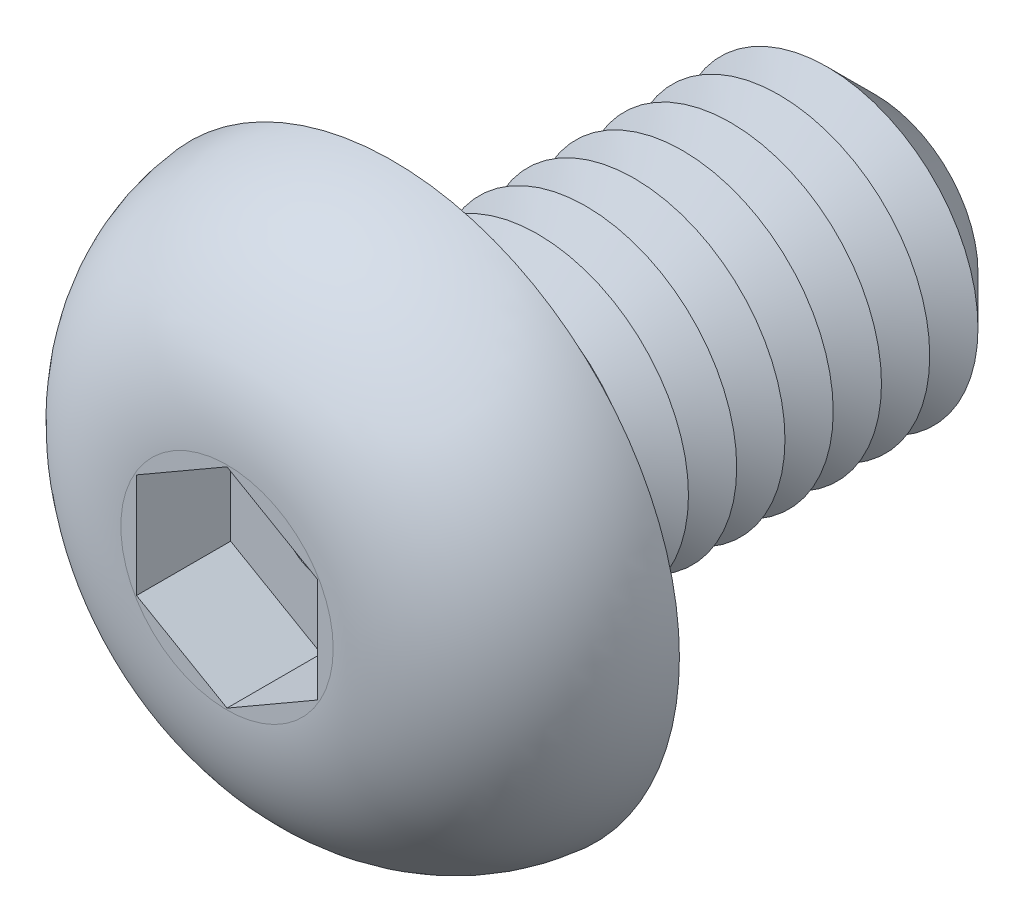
from build123d import *

# Parameters (mm, degrees)
CUT_EXTRUDE1_DEPTH  = 1.56
SKETCH4_R           = 2.5
BOSS_EXTRUDE1_DEPTH = 8
CHAMFER1_SIZE       = 0.8
LPATTERN1_COUNT     = 8
LPATTERN1_PITCH     = 0.8
FILLET2_R           = 0.4
SKETCH6_R           = 0.65
CUT_EXTRUDE2_DEPTH  = 9.19


with BuildPart() as part:
    # Sketch2 → Revolve1 (revolve)
    with BuildSketch(Plane(origin=(0, 0, 0), x_dir=(0, 0, -1), z_dir=(1, 0, 0)), mode=Mode.PRIVATE) as revolve1_sk:
        with BuildLine():
            Line((0, 0), (-2.75, 0))
            Line((-2.75, 0), (-2.75, 1.760434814))
            ThreePointArc((-2.75, 1.760434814), (-1.957940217, 3.791444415), (0, 4.75))
            Line((0, 4.75), (0, 0))
        make_face()
    revolve(revolve1_sk.sketch.rotate(Axis((0, 0, 47.934239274), (0, 0, -1)), 90), axis=Axis((0, 0, 47.934239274), (0, 0, -1)))

    # Sketch3 → Cut-Extrude1 (cut)
    with BuildSketch(Plane.XY.offset(2.75)):
        Polygon((0, 1.732050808), (-1.5, 0.866025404), (-1.5, -0.866025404), (0, -1.732050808), (1.5, -0.866025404), (1.5, 0.866025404), align=None)
    extrude(amount=-CUT_EXTRUDE1_DEPTH, mode=Mode.SUBTRACT)

    # Sketch4 → Boss-Extrude1 (add)
    with BuildSketch(Plane(origin=(0, 0, 0), x_dir=(-1, 0, 0), z_dir=(0, 0, -1))):
        with Locations(Location((0, 0, 0), (0, 0, 180))):
            Circle(SKETCH4_R)
    extrude(amount=BOSS_EXTRUDE1_DEPTH)

    # Chamfer1
    chamfer1_edges = [part.edges().sort_by_distance(p)[0] for p in [
        (-2.5, 0, -8),
    ]]
    chamfer(chamfer1_edges, length=CHAMFER1_SIZE)

    # Sketch5 → Cut-Revolve1 (revolve, cut)
    with BuildSketch(Plane(origin=(0, 0, 0), x_dir=(0, 0, -1), z_dir=(1, 0, 0)), mode=Mode.PRIVATE) as cut_revolve1_sk:
        Polygon((0.8, 2.5), (1.6, 2.5), (1.2, 1.807179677), align=None)
    cut_revolve1 = revolve(cut_revolve1_sk.sketch.rotate(Axis((0, 0, 47.934239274), (0, 0, -1)), 90), axis=Axis((0, 0, 47.934239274), (0, 0, -1)), mode=Mode.SUBTRACT)

    # LPattern1: Cut-Revolve1 ×8
    with Locations(*[(0, 0, -i * LPATTERN1_PITCH) for i in range(1, LPATTERN1_COUNT)]):
        add(cut_revolve1, mode=Mode.SUBTRACT)

    # Fillet2
    fillet2_edges = [part.edges().sort_by_distance(p)[0] for p in [
        (-2.5, 0, 0),
    ]]
    fillet(fillet2_edges, radius=FILLET2_R)

    # Sketch6 → Cut-Extrude2 (cut)
    with BuildSketch(Plane.XY.offset(1.19)):
        Circle(SKETCH6_R)
    extrude(amount=-CUT_EXTRUDE2_DEPTH, mode=Mode.SUBTRACT)


solid = part.part
